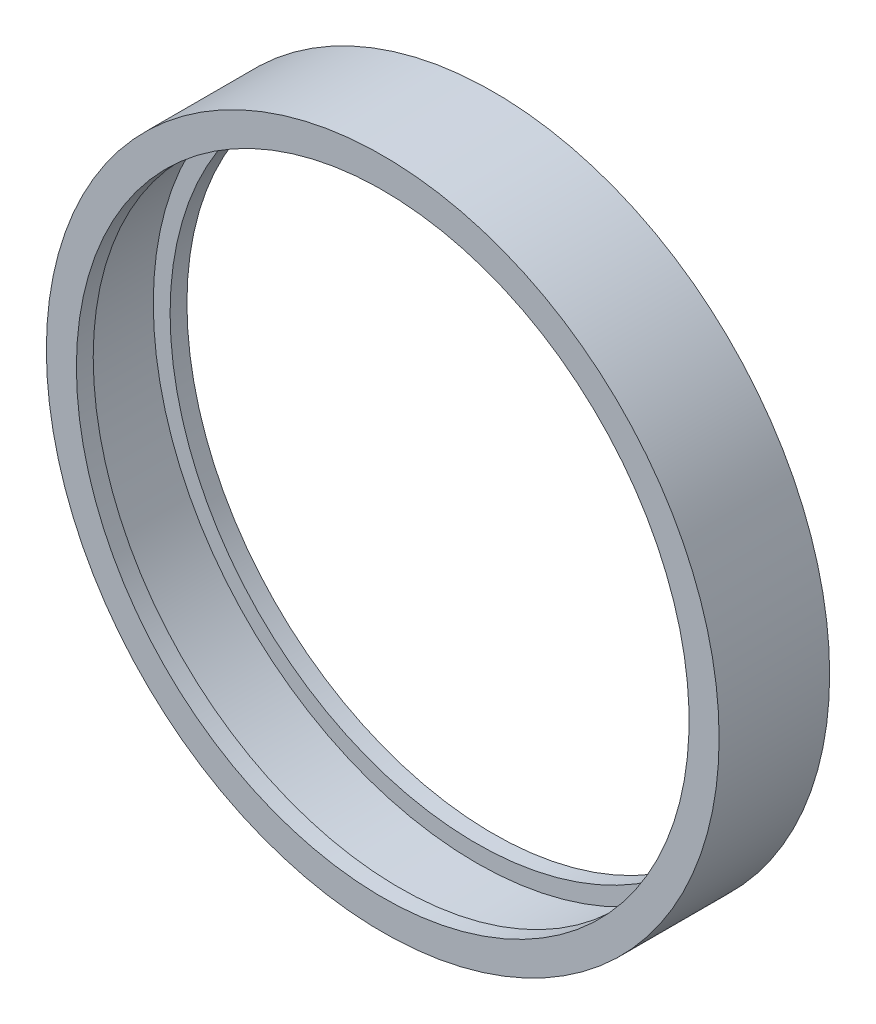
ISO-10303-21;
HEADER;
FILE_DESCRIPTION(('STEP AP214'),'2;1');
FILE_NAME('part.step','',(''),(''),'','','');
FILE_SCHEMA(('AUTOMOTIVE_DESIGN { 1 0 10303 214 1 1 1 1 }'));
ENDSEC;
DATA;
#1=APPLICATION_CONTEXT('core data for automotive mechanical design processes');
#2=APPLICATION_PROTOCOL_DEFINITION('international standard','automotive_design',2000,#1);
#3=PRODUCT_CONTEXT('',#1,'mechanical');
#4=PRODUCT('Part','Part','',(#3));
#5=PRODUCT_RELATED_PRODUCT_CATEGORY('part','',(#4));
#6=PRODUCT_DEFINITION_FORMATION('','',#4);
#7=PRODUCT_DEFINITION_CONTEXT('part definition',#1,'design');
#8=PRODUCT_DEFINITION('design','',#6,#7);
#9=PRODUCT_DEFINITION_SHAPE('','',#8);
#10=(LENGTH_UNIT() NAMED_UNIT(*) SI_UNIT(.MILLI.,.METRE.));
#11=(NAMED_UNIT(*) PLANE_ANGLE_UNIT() SI_UNIT($,.RADIAN.));
#12=(NAMED_UNIT(*) SI_UNIT($,.STERADIAN.) SOLID_ANGLE_UNIT());
#13=UNCERTAINTY_MEASURE_WITH_UNIT(LENGTH_MEASURE(1.E-05),#10,'distance_accuracy_value','');
#14=(GEOMETRIC_REPRESENTATION_CONTEXT(3) GLOBAL_UNCERTAINTY_ASSIGNED_CONTEXT((#13)) GLOBAL_UNIT_ASSIGNED_CONTEXT((#10,
#11,#12)) REPRESENTATION_CONTEXT('',''));
#15=CARTESIAN_POINT('',(0.,0.,0.));
#16=DIRECTION('',(0.,0.,1.));
#17=DIRECTION('',(1.,0.,0.));
#18=AXIS2_PLACEMENT_3D('',#15,#16,#17);
#19=CARTESIAN_POINT('',(-127.5,0.,-23.));
#20=DIRECTION('',(0.,0.,1.));
#21=DIRECTION('',(1.,0.,0.));
#22=AXIS2_PLACEMENT_3D('',#19,#20,#21);
#23=PLANE('',#22);
#24=CARTESIAN_POINT('',(0.,0.,-23.));
#25=DIRECTION('',(0.,0.,-1.));
#26=DIRECTION('',(-1.,0.,0.));
#27=AXIS2_PLACEMENT_3D('',#24,#25,#26);
#28=CIRCLE('',#27,127.5);
#29=CARTESIAN_POINT('',(-127.5,0.,-23.));
#30=VERTEX_POINT('',#29);
#31=EDGE_CURVE('E35',#30,#30,#28,.T.);
#32=ORIENTED_EDGE('',*,*,#31,.F.);
#33=EDGE_LOOP('',(#32));
#34=FACE_BOUND('',#33,.T.);
#35=CARTESIAN_POINT('',(0.,0.,-23.));
#36=DIRECTION('',(0.,0.,-1.));
#37=DIRECTION('',(-1.,0.,0.));
#38=AXIS2_PLACEMENT_3D('',#35,#36,#37);
#39=CIRCLE('',#38,140.);
#40=CARTESIAN_POINT('',(-140.,0.,-23.));
#41=VERTEX_POINT('',#40);
#42=EDGE_CURVE('E10',#41,#41,#39,.T.);
#43=ORIENTED_EDGE('',*,*,#42,.T.);
#44=EDGE_LOOP('',(#43));
#45=FACE_BOUND('',#44,.T.);
#46=ADVANCED_FACE('F29',(#34,#45),#23,.F.);
#47=CARTESIAN_POINT('',(0.,0.,0.));
#48=DIRECTION('',(0.,0.,-1.));
#49=DIRECTION('',(-1.,0.,0.));
#50=AXIS2_PLACEMENT_3D('',#47,#48,#49);
#51=CYLINDRICAL_SURFACE('',#50,127.5);
#52=CARTESIAN_POINT('',(0.,0.,-16.));
#53=DIRECTION('',(0.,0.,-1.));
#54=DIRECTION('',(-1.,0.,0.));
#55=AXIS2_PLACEMENT_3D('',#52,#53,#54);
#56=CIRCLE('',#55,127.5);
#57=CARTESIAN_POINT('',(-127.5,0.,-16.));
#58=VERTEX_POINT('',#57);
#59=EDGE_CURVE('E39',#58,#58,#56,.T.);
#60=ORIENTED_EDGE('',*,*,#59,.F.);
#61=EDGE_LOOP('',(#60));
#62=FACE_BOUND('',#61,.T.);
#63=ORIENTED_EDGE('',*,*,#31,.T.);
#64=EDGE_LOOP('',(#63));
#65=FACE_BOUND('',#64,.T.);
#66=ADVANCED_FACE('F90',(#62,#65),#51,.F.);
#67=CARTESIAN_POINT('',(-134.5,0.,-16.));
#68=DIRECTION('',(0.,0.,-1.));
#69=DIRECTION('',(-1.,0.,0.));
#70=AXIS2_PLACEMENT_3D('',#67,#68,#69);
#71=PLANE('',#70);
#72=CARTESIAN_POINT('',(0.,0.,-16.));
#73=DIRECTION('',(0.,0.,-1.));
#74=DIRECTION('',(-1.,0.,0.));
#75=AXIS2_PLACEMENT_3D('',#72,#73,#74);
#76=CIRCLE('',#75,134.5);
#77=CARTESIAN_POINT('',(-134.5,0.,-16.));
#78=VERTEX_POINT('',#77);
#79=EDGE_CURVE('E43',#78,#78,#76,.T.);
#80=ORIENTED_EDGE('',*,*,#79,.F.);
#81=EDGE_LOOP('',(#80));
#82=FACE_BOUND('',#81,.T.);
#83=ORIENTED_EDGE('',*,*,#59,.T.);
#84=EDGE_LOOP('',(#83));
#85=FACE_BOUND('',#84,.T.);
#86=ADVANCED_FACE('F84',(#82,#85),#71,.F.);
#87=CARTESIAN_POINT('',(0.,0.,0.));
#88=DIRECTION('',(0.,0.,-1.));
#89=DIRECTION('',(-1.,0.,0.));
#90=AXIS2_PLACEMENT_3D('',#87,#88,#89);
#91=CYLINDRICAL_SURFACE('',#90,134.5);
#92=CARTESIAN_POINT('',(0.,0.,16.));
#93=DIRECTION('',(0.,0.,-1.));
#94=DIRECTION('',(-1.,0.,0.));
#95=AXIS2_PLACEMENT_3D('',#92,#93,#94);
#96=CIRCLE('',#95,134.5);
#97=CARTESIAN_POINT('',(-134.5,0.,16.));
#98=VERTEX_POINT('',#97);
#99=EDGE_CURVE('E48',#98,#98,#96,.T.);
#100=ORIENTED_EDGE('',*,*,#99,.F.);
#101=EDGE_LOOP('',(#100));
#102=FACE_BOUND('',#101,.T.);
#103=ORIENTED_EDGE('',*,*,#79,.T.);
#104=EDGE_LOOP('',(#103));
#105=FACE_BOUND('',#104,.T.);
#106=ADVANCED_FACE('F78',(#102,#105),#91,.F.);
#107=CARTESIAN_POINT('',(-127.5,0.,16.));
#108=DIRECTION('',(0.,0.,1.));
#109=DIRECTION('',(1.,0.,0.));
#110=AXIS2_PLACEMENT_3D('',#107,#108,#109);
#111=PLANE('',#110);
#112=CARTESIAN_POINT('',(0.,0.,16.));
#113=DIRECTION('',(0.,0.,-1.));
#114=DIRECTION('',(-1.,0.,0.));
#115=AXIS2_PLACEMENT_3D('',#112,#113,#114);
#116=CIRCLE('',#115,127.5);
#117=CARTESIAN_POINT('',(-127.5,0.,16.));
#118=VERTEX_POINT('',#117);
#119=EDGE_CURVE('E51',#118,#118,#116,.T.);
#120=ORIENTED_EDGE('',*,*,#119,.F.);
#121=EDGE_LOOP('',(#120));
#122=FACE_BOUND('',#121,.T.);
#123=ORIENTED_EDGE('',*,*,#99,.T.);
#124=EDGE_LOOP('',(#123));
#125=FACE_BOUND('',#124,.T.);
#126=ADVANCED_FACE('F72',(#122,#125),#111,.F.);
#127=CARTESIAN_POINT('',(0.,0.,0.));
#128=DIRECTION('',(0.,0.,-1.));
#129=DIRECTION('',(-1.,0.,0.));
#130=AXIS2_PLACEMENT_3D('',#127,#128,#129);
#131=CYLINDRICAL_SURFACE('',#130,127.5);
#132=CARTESIAN_POINT('',(0.,0.,23.));
#133=DIRECTION('',(0.,0.,-1.));
#134=DIRECTION('',(-1.,0.,0.));
#135=AXIS2_PLACEMENT_3D('',#132,#133,#134);
#136=CIRCLE('',#135,127.5);
#137=CARTESIAN_POINT('',(-127.5,0.,23.));
#138=VERTEX_POINT('',#137);
#139=EDGE_CURVE('E54',#138,#138,#136,.T.);
#140=ORIENTED_EDGE('',*,*,#139,.F.);
#141=EDGE_LOOP('',(#140));
#142=FACE_BOUND('',#141,.T.);
#143=ORIENTED_EDGE('',*,*,#119,.T.);
#144=EDGE_LOOP('',(#143));
#145=FACE_BOUND('',#144,.T.);
#146=ADVANCED_FACE('F66',(#142,#145),#131,.F.);
#147=CARTESIAN_POINT('',(-140.,0.,23.));
#148=DIRECTION('',(0.,0.,-1.));
#149=DIRECTION('',(-1.,0.,0.));
#150=AXIS2_PLACEMENT_3D('',#147,#148,#149);
#151=PLANE('',#150);
#152=CARTESIAN_POINT('',(0.,0.,23.));
#153=DIRECTION('',(0.,0.,-1.));
#154=DIRECTION('',(-1.,0.,0.));
#155=AXIS2_PLACEMENT_3D('',#152,#153,#154);
#156=CIRCLE('',#155,140.);
#157=CARTESIAN_POINT('',(-140.,0.,23.));
#158=VERTEX_POINT('',#157);
#159=EDGE_CURVE('E57',#158,#158,#156,.T.);
#160=ORIENTED_EDGE('',*,*,#159,.F.);
#161=EDGE_LOOP('',(#160));
#162=FACE_BOUND('',#161,.T.);
#163=ORIENTED_EDGE('',*,*,#139,.T.);
#164=EDGE_LOOP('',(#163));
#165=FACE_BOUND('',#164,.T.);
#166=ADVANCED_FACE('F63',(#162,#165),#151,.F.);
#167=CARTESIAN_POINT('',(0.,0.,0.));
#168=DIRECTION('',(0.,0.,-1.));
#169=DIRECTION('',(-1.,0.,0.));
#170=AXIS2_PLACEMENT_3D('',#167,#168,#169);
#171=CYLINDRICAL_SURFACE('',#170,140.);
#172=ORIENTED_EDGE('',*,*,#42,.F.);
#173=EDGE_LOOP('',(#172));
#174=FACE_BOUND('',#173,.T.);
#175=ORIENTED_EDGE('',*,*,#159,.T.);
#176=EDGE_LOOP('',(#175));
#177=FACE_BOUND('',#176,.T.);
#178=ADVANCED_FACE('F61',(#174,#177),#171,.T.);
#179=CLOSED_SHELL('',(#46,#66,#86,#106,#126,#146,#166,#178));
#180=MANIFOLD_SOLID_BREP('B2',#179);
#181=ADVANCED_BREP_SHAPE_REPRESENTATION('',(#18,#180),#14);
#182=SHAPE_DEFINITION_REPRESENTATION(#9,#181);
ENDSEC;
END-ISO-10303-21;
